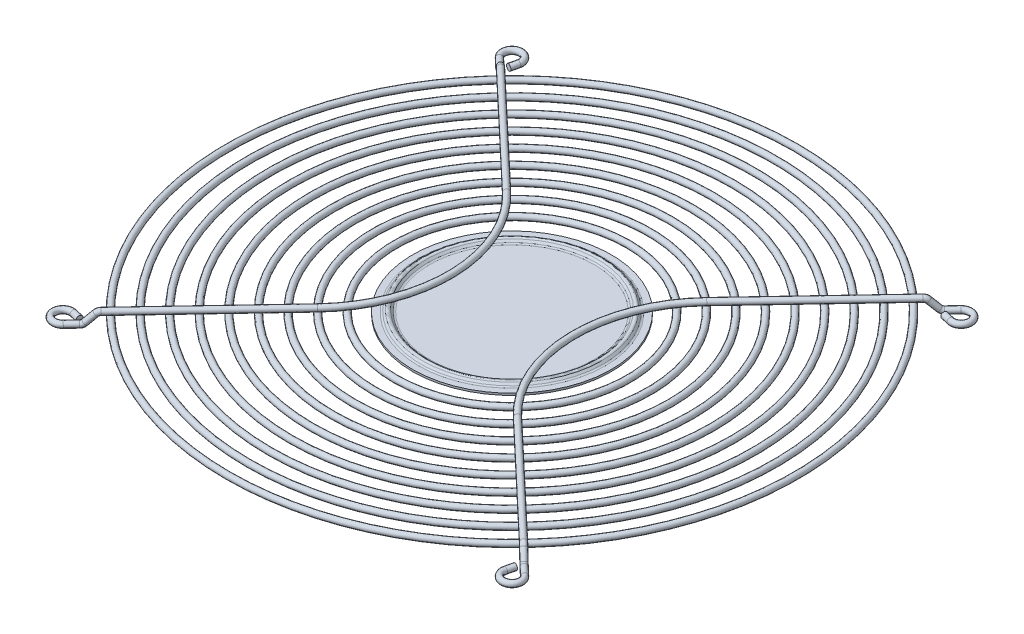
ISO-10303-21;
HEADER;
FILE_DESCRIPTION(('STEP AP214'),'2;1');
FILE_NAME('part.step','',(''),(''),'','','');
FILE_SCHEMA(('AUTOMOTIVE_DESIGN { 1 0 10303 214 1 1 1 1 }'));
ENDSEC;
DATA;
#1=APPLICATION_CONTEXT('core data for automotive mechanical design processes');
#2=APPLICATION_PROTOCOL_DEFINITION('international standard','automotive_design',2000,#1);
#3=PRODUCT_CONTEXT('',#1,'mechanical');
#4=PRODUCT('Part','Part','',(#3));
#5=PRODUCT_RELATED_PRODUCT_CATEGORY('part','',(#4));
#6=PRODUCT_DEFINITION_FORMATION('','',#4);
#7=PRODUCT_DEFINITION_CONTEXT('part definition',#1,'design');
#8=PRODUCT_DEFINITION('design','',#6,#7);
#9=PRODUCT_DEFINITION_SHAPE('','',#8);
#10=(LENGTH_UNIT() NAMED_UNIT(*) SI_UNIT(.MILLI.,.METRE.));
#11=(NAMED_UNIT(*) PLANE_ANGLE_UNIT() SI_UNIT($,.RADIAN.));
#12=(NAMED_UNIT(*) SI_UNIT($,.STERADIAN.) SOLID_ANGLE_UNIT());
#13=UNCERTAINTY_MEASURE_WITH_UNIT(LENGTH_MEASURE(1.E-05),#10,'distance_accuracy_value','');
#14=(GEOMETRIC_REPRESENTATION_CONTEXT(3) GLOBAL_UNCERTAINTY_ASSIGNED_CONTEXT((#13)) GLOBAL_UNIT_ASSIGNED_CONTEXT((#10,
#11,#12)) REPRESENTATION_CONTEXT('',''));
#15=CARTESIAN_POINT('',(0.,0.,0.));
#16=DIRECTION('',(0.,0.,1.));
#17=DIRECTION('',(1.,0.,0.));
#18=AXIS2_PLACEMENT_3D('',#15,#16,#17);
#19=CARTESIAN_POINT('',(32.2857864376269,2.04999999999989,-2.25450441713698E-13));
#20=DIRECTION('',(0.,-1.,0.));
#21=DIRECTION('',(0.,0.,-1.));
#22=AXIS2_PLACEMENT_3D('',#19,#20,#21);
#23=PLANE('',#22);
#24=CARTESIAN_POINT('',(0.,2.04999999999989,0.));
#25=DIRECTION('',(0.,-1.,0.));
#26=DIRECTION('',(0.,0.,-1.));
#27=AXIS2_PLACEMENT_3D('',#24,#25,#26);
#28=CIRCLE('',#27,32.1822330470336);
#29=CARTESIAN_POINT('',(0.,2.04999999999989,-32.1822330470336));
#30=VERTEX_POINT('',#29);
#31=EDGE_CURVE('E50',#30,#30,#28,.T.);
#32=ORIENTED_EDGE('',*,*,#31,.T.);
#33=EDGE_LOOP('',(#32));
#34=FACE_BOUND('',#33,.T.);
#35=ADVANCED_FACE('F39',(#34),#23,.T.);
#36=CARTESIAN_POINT('',(0.,3.27677669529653,0.));
#37=DIRECTION('',(0.,1.,0.));
#38=DIRECTION('',(0.,0.,1.));
#39=AXIS2_PLACEMENT_3D('',#36,#37,#38);
#40=CONICAL_SURFACE('',#39,33.8232233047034,0.78539816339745);
#41=CARTESIAN_POINT('',(0.,2.34289321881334,0.));
#42=DIRECTION('',(0.,-1.,0.));
#43=DIRECTION('',(0.,0.,-1.));
#44=AXIS2_PLACEMENT_3D('',#41,#42,#43);
#45=CIRCLE('',#44,32.8893398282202);
#46=CARTESIAN_POINT('',(0.,2.34289321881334,-32.8893398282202));
#47=VERTEX_POINT('',#46);
#48=EDGE_CURVE('E54',#47,#47,#45,.F.);
#49=ORIENTED_EDGE('',*,*,#48,.T.);
#50=EDGE_LOOP('',(#49));
#51=FACE_BOUND('',#50,.T.);
#52=CARTESIAN_POINT('',(0.,3.27677669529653,0.));
#53=DIRECTION('',(0.,1.,0.));
#54=DIRECTION('',(0.,0.,1.));
#55=AXIS2_PLACEMENT_3D('',#52,#53,#54);
#56=CIRCLE('',#55,33.8232233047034);
#57=CARTESIAN_POINT('',(0.,3.27677669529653,33.8232233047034));
#58=VERTEX_POINT('',#57);
#59=EDGE_CURVE('E71',#58,#58,#56,.T.);
#60=ORIENTED_EDGE('',*,*,#59,.F.);
#61=EDGE_LOOP('',(#60));
#62=FACE_BOUND('',#61,.T.);
#63=ADVANCED_FACE('F110',(#51,#62),#40,.T.);
#64=CARTESIAN_POINT('',(0.,3.09999999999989,0.));
#65=DIRECTION('',(0.,1.,0.));
#66=DIRECTION('',(0.,0.,1.));
#67=AXIS2_PLACEMENT_3D('',#64,#65,#66);
#68=TOROIDAL_SURFACE('',#67,34.,0.250000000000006);
#69=ORIENTED_EDGE('',*,*,#59,.T.);
#70=EDGE_LOOP('',(#69));
#71=FACE_BOUND('',#70,.T.);
#72=CARTESIAN_POINT('',(0.,3.27677669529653,0.));
#73=DIRECTION('',(0.,1.,0.));
#74=DIRECTION('',(0.,0.,1.));
#75=AXIS2_PLACEMENT_3D('',#72,#73,#74);
#76=CIRCLE('',#75,34.1767766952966);
#77=CARTESIAN_POINT('',(0.,3.27677669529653,34.1767766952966));
#78=VERTEX_POINT('',#77);
#79=EDGE_CURVE('E74',#78,#78,#76,.T.);
#80=ORIENTED_EDGE('',*,*,#79,.F.);
#81=EDGE_LOOP('',(#80));
#82=FACE_BOUND('',#81,.T.);
#83=ADVANCED_FACE('F116',(#71,#82),#68,.F.);
#84=CARTESIAN_POINT('',(0.,2.04999999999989,0.));
#85=DIRECTION('',(0.,-1.,0.));
#86=DIRECTION('',(0.,0.,-1.));
#87=AXIS2_PLACEMENT_3D('',#84,#85,#86);
#88=CONICAL_SURFACE('',#87,35.4035533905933,0.785398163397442);
#89=CARTESIAN_POINT('',(0.,2.34289321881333,0.));
#90=DIRECTION('',(0.,1.,0.));
#91=DIRECTION('',(0.,0.,1.));
#92=AXIS2_PLACEMENT_3D('',#89,#90,#91);
#93=CIRCLE('',#92,35.1106601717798);
#94=CARTESIAN_POINT('',(0.,2.34289321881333,35.1106601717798));
#95=VERTEX_POINT('',#94);
#96=EDGE_CURVE('E65',#95,#95,#93,.F.);
#97=ORIENTED_EDGE('',*,*,#96,.T.);
#98=EDGE_LOOP('',(#97));
#99=FACE_BOUND('',#98,.T.);
#100=ORIENTED_EDGE('',*,*,#79,.T.);
#101=EDGE_LOOP('',(#100));
#102=FACE_BOUND('',#101,.T.);
#103=ADVANCED_FACE('F144',(#99,#102),#88,.F.);
#104=CARTESIAN_POINT('',(38.5,2.04999999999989,-2.68844063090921E-13));
#105=DIRECTION('',(0.,-1.,0.));
#106=DIRECTION('',(0.,0.,-1.));
#107=AXIS2_PLACEMENT_3D('',#104,#105,#106);
#108=PLANE('',#107);
#109=CARTESIAN_POINT('',(0.,2.04999999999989,0.));
#110=DIRECTION('',(0.,-1.,0.));
#111=DIRECTION('',(0.,0.,-1.));
#112=AXIS2_PLACEMENT_3D('',#109,#110,#111);
#113=CIRCLE('',#112,35.8177669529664);
#114=CARTESIAN_POINT('',(0.,2.04999999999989,-35.8177669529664));
#115=VERTEX_POINT('',#114);
#116=EDGE_CURVE('E68',#115,#115,#113,.F.);
#117=ORIENTED_EDGE('',*,*,#116,.T.);
#118=EDGE_LOOP('',(#117));
#119=FACE_BOUND('',#118,.T.);
#120=CARTESIAN_POINT('',(0.,2.04999999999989,0.));
#121=DIRECTION('',(0.,1.,0.));
#122=DIRECTION('',(0.,0.,1.));
#123=AXIS2_PLACEMENT_3D('',#120,#121,#122);
#124=CIRCLE('',#123,38.5);
#125=CARTESIAN_POINT('',(0.,2.04999999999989,38.5));
#126=VERTEX_POINT('',#125);
#127=EDGE_CURVE('E77',#126,#126,#124,.T.);
#128=ORIENTED_EDGE('',*,*,#127,.F.);
#129=EDGE_LOOP('',(#128));
#130=FACE_BOUND('',#129,.T.);
#131=ADVANCED_FACE('F148',(#119,#130),#108,.T.);
#132=CARTESIAN_POINT('',(0.,2.95000000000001,0.));
#133=DIRECTION('',(0.,1.,0.));
#134=DIRECTION('',(0.,0.,1.));
#135=AXIS2_PLACEMENT_3D('',#132,#133,#134);
#136=CYLINDRICAL_SURFACE('',#135,38.5);
#137=CARTESIAN_POINT('',(0.,2.79999999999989,0.));
#138=DIRECTION('',(0.,1.,0.));
#139=DIRECTION('',(0.,0.,1.));
#140=AXIS2_PLACEMENT_3D('',#137,#138,#139);
#141=CIRCLE('',#140,38.5);
#142=CARTESIAN_POINT('',(0.,2.79999999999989,38.5));
#143=VERTEX_POINT('',#142);
#144=EDGE_CURVE('E80',#143,#143,#141,.T.);
#145=ORIENTED_EDGE('',*,*,#144,.F.);
#146=EDGE_LOOP('',(#145));
#147=FACE_BOUND('',#146,.T.);
#148=ORIENTED_EDGE('',*,*,#127,.T.);
#149=EDGE_LOOP('',(#148));
#150=FACE_BOUND('',#149,.T.);
#151=ADVANCED_FACE('F106',(#147,#150),#136,.T.);
#152=CARTESIAN_POINT('',(38.5,2.79999999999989,-2.68844063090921E-13));
#153=DIRECTION('',(0.,-1.,0.));
#154=DIRECTION('',(0.,0.,-1.));
#155=AXIS2_PLACEMENT_3D('',#152,#153,#154);
#156=PLANE('',#155);
#157=CARTESIAN_POINT('',(0.,2.79999999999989,0.));
#158=DIRECTION('',(0.,-1.,0.));
#159=DIRECTION('',(0.,0.,-1.));
#160=AXIS2_PLACEMENT_3D('',#157,#158,#159);
#161=CIRCLE('',#160,36.1284271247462);
#162=CARTESIAN_POINT('',(0.,2.79999999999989,-36.1284271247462));
#163=VERTEX_POINT('',#162);
#164=EDGE_CURVE('E59',#163,#163,#161,.T.);
#165=ORIENTED_EDGE('',*,*,#164,.T.);
#166=EDGE_LOOP('',(#165));
#167=FACE_BOUND('',#166,.T.);
#168=ORIENTED_EDGE('',*,*,#144,.T.);
#169=EDGE_LOOP('',(#168));
#170=FACE_BOUND('',#169,.T.);
#171=ADVANCED_FACE('F100',(#167,#170),#156,.F.);
#172=CARTESIAN_POINT('',(0.,2.79999999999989,0.));
#173=DIRECTION('',(0.,-1.,0.));
#174=DIRECTION('',(0.,0.,-1.));
#175=AXIS2_PLACEMENT_3D('',#172,#173,#174);
#176=CONICAL_SURFACE('',#175,35.7142135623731,0.785398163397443);
#177=CARTESIAN_POINT('',(0.,3.09289321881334,0.));
#178=DIRECTION('',(0.,-1.,0.));
#179=DIRECTION('',(0.,0.,-1.));
#180=AXIS2_PLACEMENT_3D('',#177,#178,#179);
#181=CIRCLE('',#180,35.4213203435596);
#182=CARTESIAN_POINT('',(0.,3.09289321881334,-35.4213203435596));
#183=VERTEX_POINT('',#182);
#184=EDGE_CURVE('E62',#183,#183,#181,.F.);
#185=ORIENTED_EDGE('',*,*,#184,.T.);
#186=EDGE_LOOP('',(#185));
#187=FACE_BOUND('',#186,.T.);
#188=CARTESIAN_POINT('',(0.,3.80710678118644,0.));
#189=DIRECTION('',(0.,1.,0.));
#190=DIRECTION('',(0.,0.,1.));
#191=AXIS2_PLACEMENT_3D('',#188,#189,#190);
#192=CIRCLE('',#191,34.7071067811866);
#193=CARTESIAN_POINT('',(0.,3.80710678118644,34.7071067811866));
#194=VERTEX_POINT('',#193);
#195=EDGE_CURVE('E83',#194,#194,#192,.T.);
#196=ORIENTED_EDGE('',*,*,#195,.F.);
#197=EDGE_LOOP('',(#196));
#198=FACE_BOUND('',#197,.T.);
#199=ADVANCED_FACE('F95',(#187,#198),#176,.T.);
#200=CARTESIAN_POINT('',(0.,3.09999999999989,0.));
#201=DIRECTION('',(0.,1.,0.));
#202=DIRECTION('',(0.,0.,1.));
#203=AXIS2_PLACEMENT_3D('',#200,#201,#202);
#204=TOROIDAL_SURFACE('',#203,34.,1.00000000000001);
#205=CARTESIAN_POINT('',(0.,3.80710678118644,0.));
#206=DIRECTION('',(0.,1.,0.));
#207=DIRECTION('',(0.,0.,1.));
#208=AXIS2_PLACEMENT_3D('',#205,#206,#207);
#209=CIRCLE('',#208,33.2928932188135);
#210=CARTESIAN_POINT('',(0.,3.80710678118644,33.2928932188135));
#211=VERTEX_POINT('',#210);
#212=EDGE_CURVE('E86',#211,#211,#209,.T.);
#213=ORIENTED_EDGE('',*,*,#212,.F.);
#214=EDGE_LOOP('',(#213));
#215=FACE_BOUND('',#214,.T.);
#216=ORIENTED_EDGE('',*,*,#195,.T.);
#217=EDGE_LOOP('',(#216));
#218=FACE_BOUND('',#217,.T.);
#219=ADVANCED_FACE('F92',(#215,#218),#204,.T.);
#220=CARTESIAN_POINT('',(0.,3.80710678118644,0.));
#221=DIRECTION('',(0.,1.,0.));
#222=DIRECTION('',(0.,0.,1.));
#223=AXIS2_PLACEMENT_3D('',#220,#221,#222);
#224=CONICAL_SURFACE('',#223,33.2928932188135,0.785398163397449);
#225=CARTESIAN_POINT('',(0.,3.09289321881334,0.));
#226=DIRECTION('',(0.,1.,0.));
#227=DIRECTION('',(0.,0.,1.));
#228=AXIS2_PLACEMENT_3D('',#225,#226,#227);
#229=CIRCLE('',#228,32.5786796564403);
#230=CARTESIAN_POINT('',(0.,3.09289321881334,32.5786796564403));
#231=VERTEX_POINT('',#230);
#232=EDGE_CURVE('E11',#231,#231,#229,.F.);
#233=ORIENTED_EDGE('',*,*,#232,.T.);
#234=EDGE_LOOP('',(#233));
#235=FACE_BOUND('',#234,.T.);
#236=ORIENTED_EDGE('',*,*,#212,.T.);
#237=EDGE_LOOP('',(#236));
#238=FACE_BOUND('',#237,.T.);
#239=ADVANCED_FACE('F90',(#235,#238),#224,.F.);
#240=CARTESIAN_POINT('',(32.2857864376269,2.79999999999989,-2.25450441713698E-13));
#241=DIRECTION('',(0.,-1.,0.));
#242=DIRECTION('',(0.,0.,-1.));
#243=AXIS2_PLACEMENT_3D('',#240,#241,#242);
#244=PLANE('',#243);
#245=CARTESIAN_POINT('',(0.,2.79999999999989,0.));
#246=DIRECTION('',(0.,-1.,0.));
#247=DIRECTION('',(0.,0.,-1.));
#248=AXIS2_PLACEMENT_3D('',#245,#246,#247);
#249=CIRCLE('',#248,31.8715728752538);
#250=CARTESIAN_POINT('',(0.,2.79999999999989,-31.8715728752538));
#251=VERTEX_POINT('',#250);
#252=EDGE_CURVE('E46',#251,#251,#249,.F.);
#253=ORIENTED_EDGE('',*,*,#252,.T.);
#254=EDGE_LOOP('',(#253));
#255=FACE_BOUND('',#254,.T.);
#256=ADVANCED_FACE('F125',(#255),#244,.F.);
#257=CARTESIAN_POINT('',(0.,3.04999999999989,0.));
#258=DIRECTION('',(0.,-1.,0.));
#259=DIRECTION('',(0.,0.,-1.));
#260=AXIS2_PLACEMENT_3D('',#257,#258,#259);
#261=TOROIDAL_SURFACE('',#260,35.8177669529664,1.);
#262=ORIENTED_EDGE('',*,*,#96,.F.);
#263=EDGE_LOOP('',(#262));
#264=FACE_BOUND('',#263,.T.);
#265=ORIENTED_EDGE('',*,*,#116,.F.);
#266=EDGE_LOOP('',(#265));
#267=FACE_BOUND('',#266,.T.);
#268=ADVANCED_FACE('F121',(#264,#267),#261,.T.);
#269=CARTESIAN_POINT('',(0.,3.79999999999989,0.));
#270=DIRECTION('',(0.,-1.,0.));
#271=DIRECTION('',(0.,0.,-1.));
#272=AXIS2_PLACEMENT_3D('',#269,#270,#271);
#273=TOROIDAL_SURFACE('',#272,36.1284271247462,1.);
#274=ORIENTED_EDGE('',*,*,#164,.F.);
#275=EDGE_LOOP('',(#274));
#276=FACE_BOUND('',#275,.T.);
#277=ORIENTED_EDGE('',*,*,#184,.F.);
#278=EDGE_LOOP('',(#277));
#279=FACE_BOUND('',#278,.T.);
#280=ADVANCED_FACE('F124',(#276,#279),#273,.F.);
#281=CARTESIAN_POINT('',(0.,3.04999999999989,0.));
#282=DIRECTION('',(0.,-1.,0.));
#283=DIRECTION('',(0.,0.,-1.));
#284=AXIS2_PLACEMENT_3D('',#281,#282,#283);
#285=TOROIDAL_SURFACE('',#284,32.1822330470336,1.);
#286=ORIENTED_EDGE('',*,*,#31,.F.);
#287=EDGE_LOOP('',(#286));
#288=FACE_BOUND('',#287,.T.);
#289=ORIENTED_EDGE('',*,*,#48,.F.);
#290=EDGE_LOOP('',(#289));
#291=FACE_BOUND('',#290,.T.);
#292=ADVANCED_FACE('F128',(#288,#291),#285,.T.);
#293=CARTESIAN_POINT('',(0.,3.79999999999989,0.));
#294=DIRECTION('',(0.,-1.,0.));
#295=DIRECTION('',(0.,0.,-1.));
#296=AXIS2_PLACEMENT_3D('',#293,#294,#295);
#297=TOROIDAL_SURFACE('',#296,31.8715728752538,1.);
#298=ORIENTED_EDGE('',*,*,#232,.F.);
#299=EDGE_LOOP('',(#298));
#300=FACE_BOUND('',#299,.T.);
#301=ORIENTED_EDGE('',*,*,#252,.F.);
#302=EDGE_LOOP('',(#301));
#303=FACE_BOUND('',#302,.T.);
#304=ADVANCED_FACE('F41',(#300,#303),#297,.F.);
#305=CLOSED_SHELL('',(#35,#63,#83,#103,#131,#151,#171,#199,#219,#239,#256,#268,#280,#292,#304));
#306=MANIFOLD_SOLID_BREP('B2',#305);
#307=CARTESIAN_POINT('',(38.758851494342,5.25000000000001,36.6436990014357));
#308=DIRECTION('',(0.726656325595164,0.,0.687001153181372));
#309=DIRECTION('',(0.687001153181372,0.,-0.726656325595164));
#310=AXIS2_PLACEMENT_3D('',#307,#308,#309);
#311=CYLINDRICAL_SURFACE('',#310,1.15);
#312=CARTESIAN_POINT('',(38.758851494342,5.25000000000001,36.6436990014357));
#313=DIRECTION('',(-0.726656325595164,0.,-0.687001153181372));
#314=DIRECTION('',(-0.687001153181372,0.,0.726656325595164));
#315=AXIS2_PLACEMENT_3D('',#312,#313,#314);
#316=CIRCLE('',#315,1.15);
#317=CARTESIAN_POINT('',(37.9688001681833,5.25000000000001,37.4793537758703));
#318=VERTEX_POINT('',#317);
#319=EDGE_CURVE('E38',#318,#318,#316,.T.);
#320=ORIENTED_EDGE('',*,*,#319,.F.);
#321=EDGE_LOOP('',(#320));
#322=FACE_BOUND('',#321,.T.);
#323=CARTESIAN_POINT('',(81.8578350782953,5.25000000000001,77.3906799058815));
#324=DIRECTION('',(0.726656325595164,0.,0.687001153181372));
#325=DIRECTION('',(0.687001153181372,0.,-0.726656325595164));
#326=AXIS2_PLACEMENT_3D('',#323,#324,#325);
#327=CIRCLE('',#326,1.15000000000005);
#328=CARTESIAN_POINT('',(81.8578350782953,6.40000000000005,77.3906799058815));
#329=VERTEX_POINT('',#328);
#330=EDGE_CURVE('E287',#329,#329,#327,.T.);
#331=ORIENTED_EDGE('',*,*,#330,.F.);
#332=EDGE_LOOP('',(#331));
#333=FACE_BOUND('',#332,.T.);
#334=ADVANCED_FACE('F267',(#322,#333),#311,.T.);
#335=CARTESIAN_POINT('',(86.1002005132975,1.15000000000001,81.4015304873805));
#336=DIRECTION('',(0.726656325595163,0.,0.687001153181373));
#337=DIRECTION('',(0.687001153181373,0.,-0.726656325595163));
#338=AXIS2_PLACEMENT_3D('',#335,#336,#337);
#339=CYLINDRICAL_SURFACE('',#338,1.15000000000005);
#340=CARTESIAN_POINT('',(86.1002005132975,1.15000000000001,81.4015304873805));
#341=DIRECTION('',(0.726656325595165,0.,0.687001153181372));
#342=DIRECTION('',(0.687001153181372,0.,-0.726656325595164));
#343=AXIS2_PLACEMENT_3D('',#340,#341,#342);
#344=CIRCLE('',#343,1.15000000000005);
#345=CARTESIAN_POINT('',(86.1002005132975,0.,81.4015304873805));
#346=VERTEX_POINT('',#345);
#347=EDGE_CURVE('E277',#346,#346,#344,.T.);
#348=ORIENTED_EDGE('',*,*,#347,.T.);
#349=EDGE_LOOP('',(#348));
#350=FACE_BOUND('',#349,.T.);
#351=CARTESIAN_POINT('',(89.3701539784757,1.15000000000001,84.4930356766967));
#352=DIRECTION('',(0.726656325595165,0.,0.687001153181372));
#353=DIRECTION('',(0.687001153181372,0.,-0.726656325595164));
#354=AXIS2_PLACEMENT_3D('',#351,#352,#353);
#355=CIRCLE('',#354,1.15000000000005);
#356=CARTESIAN_POINT('',(90.1602053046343,1.15000000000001,83.6573809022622));
#357=VERTEX_POINT('',#356);
#358=EDGE_CURVE('E270',#357,#357,#355,.T.);
#359=ORIENTED_EDGE('',*,*,#358,.F.);
#360=EDGE_LOOP('',(#359));
#361=FACE_BOUND('',#360,.T.);
#362=ADVANCED_FACE('F348',(#350,#361),#339,.T.);
#363=CARTESIAN_POINT('',(86.1002005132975,3.15,81.4015304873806));
#364=DIRECTION('',(-0.687001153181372,0.,0.726656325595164));
#365=DIRECTION('',(0.726656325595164,0.,0.687001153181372));
#366=AXIS2_PLACEMENT_3D('',#363,#364,#365);
#367=TOROIDAL_SURFACE('',#366,2.,1.15000000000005);
#368=CARTESIAN_POINT('',(85.0866340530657,1.7166708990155,80.4432764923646));
#369=DIRECTION('',(0.520768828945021,-0.697418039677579,0.492349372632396));
#370=DIRECTION('',(0.687001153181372,0.,-0.726656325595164));
#371=AXIS2_PLACEMENT_3D('',#368,#369,#370);
#372=CIRCLE('',#371,1.15000000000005);
#373=CARTESIAN_POINT('',(84.5038333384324,0.892506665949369,79.8922804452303));
#374=VERTEX_POINT('',#373);
#375=EDGE_CURVE('E281',#374,#374,#372,.T.);
#376=CARTESIAN_POINT('',(86.1002005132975,3.15,81.4015304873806));
#377=DIRECTION('',(-0.687001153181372,0.,0.726656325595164));
#378=DIRECTION('',(0.726656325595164,0.,0.687001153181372));
#379=AXIS2_PLACEMENT_3D('',#376,#377,#378);
#380=CIRCLE('',#379,3.15000000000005);
#381=EDGE_CURVE('',#374,#346,#380,.T.);
#382=ORIENTED_EDGE('',*,*,#375,.T.);
#383=ORIENTED_EDGE('',*,*,#347,.F.);
#384=ORIENTED_EDGE('',*,*,#381,.T.);
#385=ORIENTED_EDGE('',*,*,#381,.F.);
#386=EDGE_LOOP('',(#382,#384,#383,#385));
#387=FACE_BOUND('',#386,.T.);
#388=ADVANCED_FACE('F353',(#387),#367,.T.);
#389=CARTESIAN_POINT('',(82.8714015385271,4.68332910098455,78.3489339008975));
#390=DIRECTION('',(0.52076882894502,-0.697418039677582,0.492349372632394));
#391=DIRECTION('',(-0.801263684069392,-0.598311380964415,0.));
#392=AXIS2_PLACEMENT_3D('',#389,#390,#391);
#393=CYLINDRICAL_SURFACE('',#392,1.15000000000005);
#394=CARTESIAN_POINT('',(82.8714015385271,4.68332910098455,78.3489339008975));
#395=DIRECTION('',(0.520768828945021,-0.697418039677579,0.492349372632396));
#396=DIRECTION('',(0.687001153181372,0.,-0.726656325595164));
#397=AXIS2_PLACEMENT_3D('',#394,#395,#396);
#398=CIRCLE('',#397,1.15000000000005);
#399=CARTESIAN_POINT('',(83.4542022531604,5.50749333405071,78.8999299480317));
#400=VERTEX_POINT('',#399);
#401=EDGE_CURVE('E284',#400,#400,#398,.T.);
#402=ORIENTED_EDGE('',*,*,#401,.T.);
#403=EDGE_LOOP('',(#402));
#404=FACE_BOUND('',#403,.T.);
#405=ORIENTED_EDGE('',*,*,#375,.F.);
#406=EDGE_LOOP('',(#405));
#407=FACE_BOUND('',#406,.T.);
#408=ADVANCED_FACE('F361',(#404,#407),#393,.T.);
#409=CARTESIAN_POINT('',(81.8578350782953,3.25000000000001,77.3906799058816));
#410=DIRECTION('',(-0.687001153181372,0.,0.726656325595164));
#411=DIRECTION('',(0.726656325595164,0.,0.687001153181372));
#412=AXIS2_PLACEMENT_3D('',#409,#410,#411);
#413=TOROIDAL_SURFACE('',#412,1.99999999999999,1.15000000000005);
#414=CARTESIAN_POINT('',(81.8578350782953,3.25000000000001,77.3906799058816));
#415=DIRECTION('',(-0.687001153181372,0.,0.726656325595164));
#416=DIRECTION('',(0.726656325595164,0.,0.687001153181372));
#417=AXIS2_PLACEMENT_3D('',#414,#415,#416);
#418=CIRCLE('',#417,3.15000000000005);
#419=EDGE_CURVE('',#400,#329,#418,.T.);
#420=ORIENTED_EDGE('',*,*,#401,.F.);
#421=ORIENTED_EDGE('',*,*,#330,.T.);
#422=ORIENTED_EDGE('',*,*,#419,.T.);
#423=ORIENTED_EDGE('',*,*,#419,.F.);
#424=EDGE_LOOP('',(#420,#422,#421,#423));
#425=FACE_BOUND('',#424,.T.);
#426=ADVANCED_FACE('F358',(#425),#413,.T.);
#427=CARTESIAN_POINT('',(83.6438282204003,1.15000000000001,86.2008686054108));
#428=DIRECTION('',(0.231632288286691,0.,-0.972803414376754));
#429=DIRECTION('',(-0.972803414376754,0.,-0.231632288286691));
#430=AXIS2_PLACEMENT_3D('',#427,#428,#429);
#431=CYLINDRICAL_SURFACE('',#430,1.15000000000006);
#432=CARTESIAN_POINT('',(83.6438282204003,1.15000000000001,86.2008686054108));
#433=DIRECTION('',(0.231632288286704,0.,-0.972803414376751));
#434=DIRECTION('',(-0.972803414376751,0.,-0.231632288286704));
#435=AXIS2_PLACEMENT_3D('',#432,#433,#434);
#436=CIRCLE('',#435,1.15000000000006);
#437=CARTESIAN_POINT('',(82.5251042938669,1.15000000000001,85.9344914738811));
#438=VERTEX_POINT('',#437);
#439=EDGE_CURVE('E293',#438,#438,#436,.T.);
#440=ORIENTED_EDGE('',*,*,#439,.T.);
#441=EDGE_LOOP('',(#440));
#442=FACE_BOUND('',#441,.T.);
#443=CARTESIAN_POINT('',(84.3811498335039,1.15000000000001,83.1042839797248));
#444=DIRECTION('',(0.231632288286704,0.,-0.972803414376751));
#445=DIRECTION('',(-0.972803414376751,0.,-0.231632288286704));
#446=AXIS2_PLACEMENT_3D('',#443,#444,#445);
#447=CIRCLE('',#446,1.15000000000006);
#448=CARTESIAN_POINT('',(83.2624259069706,1.15000000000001,82.8379068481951));
#449=VERTEX_POINT('',#448);
#450=EDGE_CURVE('E290',#449,#449,#447,.T.);
#451=ORIENTED_EDGE('',*,*,#450,.F.);
#452=EDGE_LOOP('',(#451));
#453=FACE_BOUND('',#452,.T.);
#454=ADVANCED_FACE('F360',(#442,#453),#431,.T.);
#455=CARTESIAN_POINT('',(87.,1.15000000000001,87.));
#456=DIRECTION('',(0.,1.,0.));
#457=DIRECTION('',(0.,0.,-1.));
#458=AXIS2_PLACEMENT_3D('',#455,#456,#457);
#459=TOROIDAL_SURFACE('',#458,3.44999999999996,1.15000000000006);
#460=CARTESIAN_POINT('',(87.,1.15000000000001,87.));
#461=DIRECTION('',(0.,1.,0.));
#462=DIRECTION('',(0.,0.,-1.));
#463=AXIS2_PLACEMENT_3D('',#460,#461,#462);
#464=CIRCLE('',#463,4.60000000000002);
#465=EDGE_CURVE('',#438,#357,#464,.T.);
#466=ORIENTED_EDGE('',*,*,#439,.F.);
#467=ORIENTED_EDGE('',*,*,#358,.T.);
#468=ORIENTED_EDGE('',*,*,#465,.T.);
#469=ORIENTED_EDGE('',*,*,#465,.F.);
#470=EDGE_LOOP('',(#466,#468,#467,#469));
#471=FACE_BOUND('',#470,.T.);
#472=ADVANCED_FACE('F368',(#471),#459,.T.);
#473=CARTESIAN_POINT('',(84.3811498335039,1.15000000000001,83.1042839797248));
#474=DIRECTION('',(0.231632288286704,0.,-0.972803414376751));
#475=DIRECTION('',(-0.972803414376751,0.,-0.231632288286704));
#476=AXIS2_PLACEMENT_3D('',#473,#474,#475);
#477=PLANE('',#476);
#478=ORIENTED_EDGE('',*,*,#450,.T.);
#479=EDGE_LOOP('',(#478));
#480=FACE_BOUND('',#479,.T.);
#481=ADVANCED_FACE('F371',(#480),#477,.T.);
#482=CARTESIAN_POINT('',(75.4025504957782,5.25000000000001,-2.11515249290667));
#483=DIRECTION('',(0.,-1.,0.));
#484=DIRECTION('',(0.,0.,-1.));
#485=AXIS2_PLACEMENT_3D('',#482,#483,#484);
#486=TOROIDAL_SURFACE('',#485,53.3386280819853,1.15000000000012);
#487=CARTESIAN_POINT('',(36.6436990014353,5.25000000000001,-38.7588514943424));
#488=DIRECTION('',(-0.687001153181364,0.,0.726656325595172));
#489=DIRECTION('',(0.726656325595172,0.,0.687001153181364));
#490=AXIS2_PLACEMENT_3D('',#487,#488,#489);
#491=CIRCLE('',#490,1.15);
#492=CARTESIAN_POINT('',(35.8080442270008,5.25000000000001,-39.5489028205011));
#493=VERTEX_POINT('',#492);
#494=EDGE_CURVE('E296',#493,#493,#491,.T.);
#495=CARTESIAN_POINT('',(75.4025504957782,5.25000000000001,-2.11515249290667));
#496=DIRECTION('',(0.,-1.,0.));
#497=DIRECTION('',(0.,0.,-1.));
#498=AXIS2_PLACEMENT_3D('',#495,#496,#497);
#499=CIRCLE('',#498,54.4886280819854);
#500=EDGE_CURVE('',#318,#493,#499,.T.);
#501=ORIENTED_EDGE('',*,*,#319,.T.);
#502=ORIENTED_EDGE('',*,*,#494,.T.);
#503=ORIENTED_EDGE('',*,*,#500,.T.);
#504=ORIENTED_EDGE('',*,*,#500,.F.);
#505=EDGE_LOOP('',(#501,#503,#502,#504));
#506=FACE_BOUND('',#505,.T.);
#507=ADVANCED_FACE('F344',(#506),#486,.T.);
#508=CARTESIAN_POINT('',(36.6436990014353,5.25000000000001,-38.7588514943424));
#509=DIRECTION('',(0.687001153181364,0.,-0.726656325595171));
#510=DIRECTION('',(-0.726656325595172,0.,-0.687001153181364));
#511=AXIS2_PLACEMENT_3D('',#508,#509,#510);
#512=CYLINDRICAL_SURFACE('',#511,1.15);
#513=ORIENTED_EDGE('',*,*,#494,.F.);
#514=EDGE_LOOP('',(#513));
#515=FACE_BOUND('',#514,.T.);
#516=CARTESIAN_POINT('',(77.3906799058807,5.25000000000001,-81.8578350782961));
#517=DIRECTION('',(0.687001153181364,0.,-0.726656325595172));
#518=DIRECTION('',(-0.726656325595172,0.,-0.687001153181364));
#519=AXIS2_PLACEMENT_3D('',#516,#517,#518);
#520=CIRCLE('',#519,1.15000000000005);
#521=CARTESIAN_POINT('',(77.3906799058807,6.40000000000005,-81.8578350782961));
#522=VERTEX_POINT('',#521);
#523=EDGE_CURVE('E311',#522,#522,#520,.T.);
#524=ORIENTED_EDGE('',*,*,#523,.F.);
#525=EDGE_LOOP('',(#524));
#526=FACE_BOUND('',#525,.T.);
#527=ADVANCED_FACE('F334',(#515,#526),#512,.T.);
#528=CARTESIAN_POINT('',(81.4015304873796,1.15000000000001,-86.1002005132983));
#529=DIRECTION('',(0.687001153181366,0.,-0.72665632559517));
#530=DIRECTION('',(-0.72665632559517,0.,-0.687001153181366));
#531=AXIS2_PLACEMENT_3D('',#528,#529,#530);
#532=CYLINDRICAL_SURFACE('',#531,1.15000000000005);
#533=CARTESIAN_POINT('',(81.4015304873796,1.15000000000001,-86.1002005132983));
#534=DIRECTION('',(0.687001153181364,0.,-0.726656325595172));
#535=DIRECTION('',(-0.726656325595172,0.,-0.687001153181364));
#536=AXIS2_PLACEMENT_3D('',#533,#534,#535);
#537=CIRCLE('',#536,1.15000000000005);
#538=CARTESIAN_POINT('',(81.4015304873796,0.,-86.1002005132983));
#539=VERTEX_POINT('',#538);
#540=EDGE_CURVE('E300',#539,#539,#537,.T.);
#541=ORIENTED_EDGE('',*,*,#540,.T.);
#542=EDGE_LOOP('',(#541));
#543=FACE_BOUND('',#542,.T.);
#544=CARTESIAN_POINT('',(84.4930356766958,1.15000000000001,-89.3701539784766));
#545=DIRECTION('',(0.687001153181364,0.,-0.726656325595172));
#546=DIRECTION('',(-0.726656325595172,0.,-0.687001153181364));
#547=AXIS2_PLACEMENT_3D('',#544,#545,#546);
#548=CIRCLE('',#547,1.15000000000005);
#549=CARTESIAN_POINT('',(83.6573809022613,1.15000000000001,-90.1602053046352));
#550=VERTEX_POINT('',#549);
#551=EDGE_CURVE('E297',#550,#550,#548,.T.);
#552=ORIENTED_EDGE('',*,*,#551,.F.);
#553=EDGE_LOOP('',(#552));
#554=FACE_BOUND('',#553,.T.);
#555=ADVANCED_FACE('F331',(#543,#554),#532,.T.);
#556=CARTESIAN_POINT('',(81.4015304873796,3.15,-86.1002005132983));
#557=DIRECTION('',(0.726656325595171,0.,0.687001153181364));
#558=DIRECTION('',(0.687001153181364,0.,-0.726656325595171));
#559=AXIS2_PLACEMENT_3D('',#556,#557,#558);
#560=TOROIDAL_SURFACE('',#559,2.,1.15000000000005);
#561=CARTESIAN_POINT('',(80.4432764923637,1.7166708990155,-85.0866340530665));
#562=DIRECTION('',(0.492349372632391,-0.697418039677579,-0.520768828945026));
#563=DIRECTION('',(-0.726656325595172,0.,-0.687001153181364));
#564=AXIS2_PLACEMENT_3D('',#561,#562,#563);
#565=CIRCLE('',#564,1.15000000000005);
#566=CARTESIAN_POINT('',(79.8922804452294,0.892506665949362,-84.5038333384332));
#567=VERTEX_POINT('',#566);
#568=EDGE_CURVE('E305',#567,#567,#565,.T.);
#569=CARTESIAN_POINT('',(81.4015304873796,3.15,-86.1002005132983));
#570=DIRECTION('',(0.726656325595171,0.,0.687001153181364));
#571=DIRECTION('',(0.687001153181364,0.,-0.726656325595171));
#572=AXIS2_PLACEMENT_3D('',#569,#570,#571);
#573=CIRCLE('',#572,3.15000000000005);
#574=EDGE_CURVE('',#567,#539,#573,.T.);
#575=ORIENTED_EDGE('',*,*,#568,.T.);
#576=ORIENTED_EDGE('',*,*,#540,.F.);
#577=ORIENTED_EDGE('',*,*,#574,.T.);
#578=ORIENTED_EDGE('',*,*,#574,.F.);
#579=EDGE_LOOP('',(#575,#577,#576,#578));
#580=FACE_BOUND('',#579,.T.);
#581=ADVANCED_FACE('F333',(#580),#560,.T.);
#582=CARTESIAN_POINT('',(78.3489339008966,4.68332910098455,-82.8714015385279));
#583=DIRECTION('',(0.492349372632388,-0.697418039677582,-0.520768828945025));
#584=DIRECTION('',(0.,-0.598311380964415,0.801263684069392));
#585=AXIS2_PLACEMENT_3D('',#582,#583,#584);
#586=CYLINDRICAL_SURFACE('',#585,1.15000000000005);
#587=CARTESIAN_POINT('',(78.3489339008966,4.68332910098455,-82.8714015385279));
#588=DIRECTION('',(0.492349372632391,-0.697418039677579,-0.520768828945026));
#589=DIRECTION('',(-0.726656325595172,0.,-0.687001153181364));
#590=AXIS2_PLACEMENT_3D('',#587,#588,#589);
#591=CIRCLE('',#590,1.15000000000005);
#592=CARTESIAN_POINT('',(78.8999299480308,5.50749333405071,-83.4542022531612));
#593=VERTEX_POINT('',#592);
#594=EDGE_CURVE('E308',#593,#593,#591,.T.);
#595=ORIENTED_EDGE('',*,*,#594,.T.);
#596=EDGE_LOOP('',(#595));
#597=FACE_BOUND('',#596,.T.);
#598=ORIENTED_EDGE('',*,*,#568,.F.);
#599=EDGE_LOOP('',(#598));
#600=FACE_BOUND('',#599,.T.);
#601=ADVANCED_FACE('F341',(#597,#600),#586,.T.);
#602=CARTESIAN_POINT('',(77.3906799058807,3.25000000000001,-81.8578350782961));
#603=DIRECTION('',(0.726656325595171,0.,0.687001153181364));
#604=DIRECTION('',(0.687001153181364,0.,-0.726656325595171));
#605=AXIS2_PLACEMENT_3D('',#602,#603,#604);
#606=TOROIDAL_SURFACE('',#605,1.99999999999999,1.15000000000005);
#607=CARTESIAN_POINT('',(77.3906799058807,3.25000000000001,-81.8578350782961));
#608=DIRECTION('',(0.726656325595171,0.,0.687001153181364));
#609=DIRECTION('',(0.687001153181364,0.,-0.726656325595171));
#610=AXIS2_PLACEMENT_3D('',#607,#608,#609);
#611=CIRCLE('',#610,3.15000000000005);
#612=EDGE_CURVE('',#593,#522,#611,.T.);
#613=ORIENTED_EDGE('',*,*,#594,.F.);
#614=ORIENTED_EDGE('',*,*,#523,.T.);
#615=ORIENTED_EDGE('',*,*,#612,.T.);
#616=ORIENTED_EDGE('',*,*,#612,.F.);
#617=EDGE_LOOP('',(#613,#615,#614,#616));
#618=FACE_BOUND('',#617,.T.);
#619=ADVANCED_FACE('F404',(#618),#606,.T.);
#620=CARTESIAN_POINT('',(86.20086860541,1.15000000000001,-83.6438282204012));
#621=DIRECTION('',(-0.972803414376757,0.,-0.231632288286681));
#622=DIRECTION('',(-0.231632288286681,0.,0.972803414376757));
#623=AXIS2_PLACEMENT_3D('',#620,#621,#622);
#624=CYLINDRICAL_SURFACE('',#623,1.15000000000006);
#625=CARTESIAN_POINT('',(86.20086860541,1.15000000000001,-83.6438282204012));
#626=DIRECTION('',(-0.972803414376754,0.,-0.231632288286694));
#627=DIRECTION('',(-0.231632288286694,0.,0.972803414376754));
#628=AXIS2_PLACEMENT_3D('',#625,#626,#627);
#629=CIRCLE('',#628,1.15000000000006);
#630=CARTESIAN_POINT('',(85.9344914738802,1.15000000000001,-82.5251042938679));
#631=VERTEX_POINT('',#630);
#632=EDGE_CURVE('E317',#631,#631,#629,.T.);
#633=ORIENTED_EDGE('',*,*,#632,.T.);
#634=EDGE_LOOP('',(#633));
#635=FACE_BOUND('',#634,.T.);
#636=CARTESIAN_POINT('',(83.1042839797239,1.15000000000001,-84.3811498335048));
#637=DIRECTION('',(-0.972803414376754,0.,-0.231632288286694));
#638=DIRECTION('',(-0.231632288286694,0.,0.972803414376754));
#639=AXIS2_PLACEMENT_3D('',#636,#637,#638);
#640=CIRCLE('',#639,1.15000000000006);
#641=CARTESIAN_POINT('',(82.8379068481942,1.15000000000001,-83.2624259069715));
#642=VERTEX_POINT('',#641);
#643=EDGE_CURVE('E314',#642,#642,#640,.T.);
#644=ORIENTED_EDGE('',*,*,#643,.F.);
#645=EDGE_LOOP('',(#644));
#646=FACE_BOUND('',#645,.T.);
#647=ADVANCED_FACE('F321',(#635,#646),#624,.T.);
#648=CARTESIAN_POINT('',(86.9999999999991,1.15000000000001,-87.0000000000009));
#649=DIRECTION('',(0.,1.,0.));
#650=DIRECTION('',(-1.,0.,0.));
#651=AXIS2_PLACEMENT_3D('',#648,#649,#650);
#652=TOROIDAL_SURFACE('',#651,3.44999999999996,1.15000000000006);
#653=CARTESIAN_POINT('',(86.9999999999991,1.15000000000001,-87.0000000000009));
#654=DIRECTION('',(0.,1.,0.));
#655=DIRECTION('',(-1.,0.,0.));
#656=AXIS2_PLACEMENT_3D('',#653,#654,#655);
#657=CIRCLE('',#656,4.60000000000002);
#658=EDGE_CURVE('',#631,#550,#657,.T.);
#659=ORIENTED_EDGE('',*,*,#632,.F.);
#660=ORIENTED_EDGE('',*,*,#551,.T.);
#661=ORIENTED_EDGE('',*,*,#658,.T.);
#662=ORIENTED_EDGE('',*,*,#658,.F.);
#663=EDGE_LOOP('',(#659,#661,#660,#662));
#664=FACE_BOUND('',#663,.T.);
#665=ADVANCED_FACE('F324',(#664),#652,.T.);
#666=CARTESIAN_POINT('',(83.1042839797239,1.15000000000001,-84.3811498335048));
#667=DIRECTION('',(-0.972803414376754,0.,-0.231632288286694));
#668=DIRECTION('',(-0.231632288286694,0.,0.972803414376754));
#669=AXIS2_PLACEMENT_3D('',#666,#667,#668);
#670=PLANE('',#669);
#671=ORIENTED_EDGE('',*,*,#643,.T.);
#672=EDGE_LOOP('',(#671));
#673=FACE_BOUND('',#672,.T.);
#674=ADVANCED_FACE('F327',(#673),#670,.T.);
#675=CLOSED_SHELL('',(#334,#362,#388,#408,#426,#454,#472,#481,#507,#527,#555,#581,#601,#619,
#647,#665,#674));
#676=MANIFOLD_SOLID_BREP('B6',#675);
#677=CARTESIAN_POINT('',(-36.6436990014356,5.25000000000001,38.7588514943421));
#678=DIRECTION('',(-0.687001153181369,0.,0.726656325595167));
#679=DIRECTION('',(0.726656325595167,0.,0.687001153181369));
#680=AXIS2_PLACEMENT_3D('',#677,#678,#679);
#681=CYLINDRICAL_SURFACE('',#680,1.15);
#682=CARTESIAN_POINT('',(-36.6436990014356,5.25000000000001,38.7588514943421));
#683=DIRECTION('',(0.687001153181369,0.,-0.726656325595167));
#684=DIRECTION('',(-0.726656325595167,0.,-0.687001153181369));
#685=AXIS2_PLACEMENT_3D('',#682,#683,#684);
#686=CIRCLE('',#685,1.15);
#687=CARTESIAN_POINT('',(-35.8080442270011,5.25000000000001,39.5489028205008));
#688=VERTEX_POINT('',#687);
#689=EDGE_CURVE('E266',#688,#688,#686,.T.);
#690=ORIENTED_EDGE('',*,*,#689,.F.);
#691=EDGE_LOOP('',(#690));
#692=FACE_BOUND('',#691,.T.);
#693=CARTESIAN_POINT('',(-77.3906799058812,5.25000000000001,81.8578350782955));
#694=DIRECTION('',(-0.687001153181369,0.,0.726656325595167));
#695=DIRECTION('',(0.726656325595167,0.,0.687001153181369));
#696=AXIS2_PLACEMENT_3D('',#693,#694,#695);
#697=CIRCLE('',#696,1.15000000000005);
#698=CARTESIAN_POINT('',(-77.3906799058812,6.40000000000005,81.8578350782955));
#699=VERTEX_POINT('',#698);
#700=EDGE_CURVE('E543',#699,#699,#697,.T.);
#701=ORIENTED_EDGE('',*,*,#700,.F.);
#702=EDGE_LOOP('',(#701));
#703=FACE_BOUND('',#702,.T.);
#704=ADVANCED_FACE('F523',(#692,#703),#681,.T.);
#705=CARTESIAN_POINT('',(-81.4015304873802,1.15000000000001,86.1002005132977));
#706=DIRECTION('',(-0.687001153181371,0.,0.726656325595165));
#707=DIRECTION('',(0.726656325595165,0.,0.687001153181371));
#708=AXIS2_PLACEMENT_3D('',#705,#706,#707);
#709=CYLINDRICAL_SURFACE('',#708,1.15000000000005);
#710=CARTESIAN_POINT('',(-81.4015304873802,1.15000000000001,86.1002005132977));
#711=DIRECTION('',(-0.687001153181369,0.,0.726656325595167));
#712=DIRECTION('',(0.726656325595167,0.,0.687001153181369));
#713=AXIS2_PLACEMENT_3D('',#710,#711,#712);
#714=CIRCLE('',#713,1.15000000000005);
#715=CARTESIAN_POINT('',(-81.4015304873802,0.,86.1002005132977));
#716=VERTEX_POINT('',#715);
#717=EDGE_CURVE('E533',#716,#716,#714,.T.);
#718=ORIENTED_EDGE('',*,*,#717,.T.);
#719=EDGE_LOOP('',(#718));
#720=FACE_BOUND('',#719,.T.);
#721=CARTESIAN_POINT('',(-84.4930356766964,1.15000000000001,89.370153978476));
#722=DIRECTION('',(-0.687001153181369,0.,0.726656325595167));
#723=DIRECTION('',(0.726656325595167,0.,0.687001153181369));
#724=AXIS2_PLACEMENT_3D('',#721,#722,#723);
#725=CIRCLE('',#724,1.15000000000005);
#726=CARTESIAN_POINT('',(-83.6573809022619,1.15000000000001,90.1602053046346));
#727=VERTEX_POINT('',#726);
#728=EDGE_CURVE('E526',#727,#727,#725,.T.);
#729=ORIENTED_EDGE('',*,*,#728,.F.);
#730=EDGE_LOOP('',(#729));
#731=FACE_BOUND('',#730,.T.);
#732=ADVANCED_FACE('F604',(#720,#731),#709,.T.);
#733=CARTESIAN_POINT('',(-81.4015304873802,3.15,86.1002005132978));
#734=DIRECTION('',(-0.726656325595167,0.,-0.687001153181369));
#735=DIRECTION('',(-0.687001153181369,0.,0.726656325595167));
#736=AXIS2_PLACEMENT_3D('',#733,#734,#735);
#737=TOROIDAL_SURFACE('',#736,2.,1.15000000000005);
#738=CARTESIAN_POINT('',(-80.4432764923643,1.7166708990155,85.086634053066));
#739=DIRECTION('',(-0.492349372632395,-0.697418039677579,0.520768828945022));
#740=DIRECTION('',(0.726656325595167,0.,0.687001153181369));
#741=AXIS2_PLACEMENT_3D('',#738,#739,#740);
#742=CIRCLE('',#741,1.15000000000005);
#743=CARTESIAN_POINT('',(-79.89228044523,0.892506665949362,84.5038333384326));
#744=VERTEX_POINT('',#743);
#745=EDGE_CURVE('E537',#744,#744,#742,.T.);
#746=CARTESIAN_POINT('',(-81.4015304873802,3.15,86.1002005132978));
#747=DIRECTION('',(-0.726656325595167,0.,-0.687001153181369));
#748=DIRECTION('',(-0.687001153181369,0.,0.726656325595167));
#749=AXIS2_PLACEMENT_3D('',#746,#747,#748);
#750=CIRCLE('',#749,3.15000000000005);
#751=EDGE_CURVE('',#744,#716,#750,.T.);
#752=ORIENTED_EDGE('',*,*,#745,.T.);
#753=ORIENTED_EDGE('',*,*,#717,.F.);
#754=ORIENTED_EDGE('',*,*,#751,.T.);
#755=ORIENTED_EDGE('',*,*,#751,.F.);
#756=EDGE_LOOP('',(#752,#754,#753,#755));
#757=FACE_BOUND('',#756,.T.);
#758=ADVANCED_FACE('F609',(#757),#737,.T.);
#759=CARTESIAN_POINT('',(-78.3489339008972,4.68332910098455,82.8714015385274));
#760=DIRECTION('',(-0.492349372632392,-0.697418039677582,0.520768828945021));
#761=DIRECTION('',(0.,-0.598311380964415,-0.801263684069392));
#762=AXIS2_PLACEMENT_3D('',#759,#760,#761);
#763=CYLINDRICAL_SURFACE('',#762,1.15000000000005);
#764=CARTESIAN_POINT('',(-78.3489339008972,4.68332910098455,82.8714015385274));
#765=DIRECTION('',(-0.492349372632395,-0.697418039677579,0.520768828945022));
#766=DIRECTION('',(0.726656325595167,0.,0.687001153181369));
#767=AXIS2_PLACEMENT_3D('',#764,#765,#766);
#768=CIRCLE('',#767,1.15000000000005);
#769=CARTESIAN_POINT('',(-78.8999299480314,5.5074933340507,83.4542022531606));
#770=VERTEX_POINT('',#769);
#771=EDGE_CURVE('E540',#770,#770,#768,.T.);
#772=ORIENTED_EDGE('',*,*,#771,.T.);
#773=EDGE_LOOP('',(#772));
#774=FACE_BOUND('',#773,.T.);
#775=ORIENTED_EDGE('',*,*,#745,.F.);
#776=EDGE_LOOP('',(#775));
#777=FACE_BOUND('',#776,.T.);
#778=ADVANCED_FACE('F617',(#774,#777),#763,.T.);
#779=CARTESIAN_POINT('',(-77.3906799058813,3.25000000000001,81.8578350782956));
#780=DIRECTION('',(-0.726656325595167,0.,-0.687001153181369));
#781=DIRECTION('',(-0.687001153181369,0.,0.726656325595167));
#782=AXIS2_PLACEMENT_3D('',#779,#780,#781);
#783=TOROIDAL_SURFACE('',#782,1.99999999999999,1.15000000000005);
#784=CARTESIAN_POINT('',(-77.3906799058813,3.25000000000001,81.8578350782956));
#785=DIRECTION('',(-0.726656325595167,0.,-0.687001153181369));
#786=DIRECTION('',(-0.687001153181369,0.,0.726656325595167));
#787=AXIS2_PLACEMENT_3D('',#784,#785,#786);
#788=CIRCLE('',#787,3.15000000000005);
#789=EDGE_CURVE('',#770,#699,#788,.T.);
#790=ORIENTED_EDGE('',*,*,#771,.F.);
#791=ORIENTED_EDGE('',*,*,#700,.T.);
#792=ORIENTED_EDGE('',*,*,#789,.T.);
#793=ORIENTED_EDGE('',*,*,#789,.F.);
#794=EDGE_LOOP('',(#790,#792,#791,#793));
#795=FACE_BOUND('',#794,.T.);
#796=ADVANCED_FACE('F614',(#795),#783,.T.);
#797=CARTESIAN_POINT('',(-86.2008686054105,1.15000000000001,83.6438282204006));
#798=DIRECTION('',(0.972803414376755,0.,0.231632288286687));
#799=DIRECTION('',(0.231632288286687,0.,-0.972803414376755));
#800=AXIS2_PLACEMENT_3D('',#797,#798,#799);
#801=CYLINDRICAL_SURFACE('',#800,1.15000000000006);
#802=CARTESIAN_POINT('',(-86.2008686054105,1.15000000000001,83.6438282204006));
#803=DIRECTION('',(0.972803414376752,0.,0.231632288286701));
#804=DIRECTION('',(0.231632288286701,0.,-0.972803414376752));
#805=AXIS2_PLACEMENT_3D('',#802,#803,#804);
#806=CIRCLE('',#805,1.15000000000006);
#807=CARTESIAN_POINT('',(-85.9344914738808,1.15000000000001,82.5251042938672));
#808=VERTEX_POINT('',#807);
#809=EDGE_CURVE('E549',#808,#808,#806,.T.);
#810=ORIENTED_EDGE('',*,*,#809,.T.);
#811=EDGE_LOOP('',(#810));
#812=FACE_BOUND('',#811,.T.);
#813=CARTESIAN_POINT('',(-83.1042839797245,1.15000000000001,84.3811498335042));
#814=DIRECTION('',(0.972803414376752,0.,0.231632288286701));
#815=DIRECTION('',(0.231632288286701,0.,-0.972803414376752));
#816=AXIS2_PLACEMENT_3D('',#813,#814,#815);
#817=CIRCLE('',#816,1.15000000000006);
#818=CARTESIAN_POINT('',(-82.8379068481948,1.15000000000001,83.2624259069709));
#819=VERTEX_POINT('',#818);
#820=EDGE_CURVE('E546',#819,#819,#817,.T.);
#821=ORIENTED_EDGE('',*,*,#820,.F.);
#822=EDGE_LOOP('',(#821));
#823=FACE_BOUND('',#822,.T.);
#824=ADVANCED_FACE('F616',(#812,#823),#801,.T.);
#825=CARTESIAN_POINT('',(-86.9999999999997,1.15000000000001,87.0000000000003));
#826=DIRECTION('',(0.,1.,0.));
#827=DIRECTION('',(1.,0.,0.));
#828=AXIS2_PLACEMENT_3D('',#825,#826,#827);
#829=TOROIDAL_SURFACE('',#828,3.44999999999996,1.15000000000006);
#830=CARTESIAN_POINT('',(-86.9999999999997,1.15000000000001,87.0000000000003));
#831=DIRECTION('',(0.,1.,0.));
#832=DIRECTION('',(1.,0.,0.));
#833=AXIS2_PLACEMENT_3D('',#830,#831,#832);
#834=CIRCLE('',#833,4.60000000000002);
#835=EDGE_CURVE('',#808,#727,#834,.T.);
#836=ORIENTED_EDGE('',*,*,#809,.F.);
#837=ORIENTED_EDGE('',*,*,#728,.T.);
#838=ORIENTED_EDGE('',*,*,#835,.T.);
#839=ORIENTED_EDGE('',*,*,#835,.F.);
#840=EDGE_LOOP('',(#836,#838,#837,#839));
#841=FACE_BOUND('',#840,.T.);
#842=ADVANCED_FACE('F624',(#841),#829,.T.);
#843=CARTESIAN_POINT('',(-83.1042839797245,1.15000000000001,84.3811498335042));
#844=DIRECTION('',(0.972803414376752,0.,0.231632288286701));
#845=DIRECTION('',(0.231632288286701,0.,-0.972803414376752));
#846=AXIS2_PLACEMENT_3D('',#843,#844,#845);
#847=PLANE('',#846);
#848=ORIENTED_EDGE('',*,*,#820,.T.);
#849=EDGE_LOOP('',(#848));
#850=FACE_BOUND('',#849,.T.);
#851=ADVANCED_FACE('F627',(#850),#847,.T.);
#852=CARTESIAN_POINT('',(-75.402550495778,5.25000000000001,2.11515249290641));
#853=DIRECTION('',(0.,1.,0.));
#854=DIRECTION('',(0.,0.,1.));
#855=AXIS2_PLACEMENT_3D('',#852,#853,#854);
#856=TOROIDAL_SURFACE('',#855,53.3386280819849,1.15000000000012);
#857=CARTESIAN_POINT('',(-38.758851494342,5.25000000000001,-36.6436990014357));
#858=DIRECTION('',(0.726656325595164,0.,0.687001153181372));
#859=DIRECTION('',(0.687001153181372,0.,-0.726656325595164));
#860=AXIS2_PLACEMENT_3D('',#857,#858,#859);
#861=CIRCLE('',#860,1.15);
#862=CARTESIAN_POINT('',(-37.9688001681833,5.25000000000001,-37.4793537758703));
#863=VERTEX_POINT('',#862);
#864=EDGE_CURVE('E552',#863,#863,#861,.T.);
#865=CARTESIAN_POINT('',(-75.402550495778,5.25000000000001,2.11515249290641));
#866=DIRECTION('',(0.,1.,0.));
#867=DIRECTION('',(0.,0.,1.));
#868=AXIS2_PLACEMENT_3D('',#865,#866,#867);
#869=CIRCLE('',#868,54.488628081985);
#870=EDGE_CURVE('',#688,#863,#869,.T.);
#871=ORIENTED_EDGE('',*,*,#689,.T.);
#872=ORIENTED_EDGE('',*,*,#864,.T.);
#873=ORIENTED_EDGE('',*,*,#870,.T.);
#874=ORIENTED_EDGE('',*,*,#870,.F.);
#875=EDGE_LOOP('',(#871,#873,#872,#874));
#876=FACE_BOUND('',#875,.T.);
#877=ADVANCED_FACE('F600',(#876),#856,.T.);
#878=CARTESIAN_POINT('',(-38.758851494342,5.25000000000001,-36.6436990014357));
#879=DIRECTION('',(-0.726656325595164,0.,-0.687001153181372));
#880=DIRECTION('',(-0.687001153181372,0.,0.726656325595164));
#881=AXIS2_PLACEMENT_3D('',#878,#879,#880);
#882=CYLINDRICAL_SURFACE('',#881,1.15);
#883=ORIENTED_EDGE('',*,*,#864,.F.);
#884=EDGE_LOOP('',(#883));
#885=FACE_BOUND('',#884,.T.);
#886=CARTESIAN_POINT('',(-81.8578350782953,5.25000000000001,-77.3906799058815));
#887=DIRECTION('',(-0.726656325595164,0.,-0.687001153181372));
#888=DIRECTION('',(-0.687001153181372,0.,0.726656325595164));
#889=AXIS2_PLACEMENT_3D('',#886,#887,#888);
#890=CIRCLE('',#889,1.15000000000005);
#891=CARTESIAN_POINT('',(-81.8578350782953,6.40000000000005,-77.3906799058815));
#892=VERTEX_POINT('',#891);
#893=EDGE_CURVE('E567',#892,#892,#890,.T.);
#894=ORIENTED_EDGE('',*,*,#893,.F.);
#895=EDGE_LOOP('',(#894));
#896=FACE_BOUND('',#895,.T.);
#897=ADVANCED_FACE('F590',(#885,#896),#882,.T.);
#898=CARTESIAN_POINT('',(-86.1002005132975,1.15000000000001,-81.4015304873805));
#899=DIRECTION('',(-0.726656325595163,0.,-0.687001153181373));
#900=DIRECTION('',(-0.687001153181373,0.,0.726656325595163));
#901=AXIS2_PLACEMENT_3D('',#898,#899,#900);
#902=CYLINDRICAL_SURFACE('',#901,1.15000000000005);
#903=CARTESIAN_POINT('',(-86.1002005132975,1.15000000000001,-81.4015304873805));
#904=DIRECTION('',(-0.726656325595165,0.,-0.687001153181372));
#905=DIRECTION('',(-0.687001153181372,0.,0.726656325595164));
#906=AXIS2_PLACEMENT_3D('',#903,#904,#905);
#907=CIRCLE('',#906,1.15000000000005);
#908=CARTESIAN_POINT('',(-86.1002005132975,0.,-81.4015304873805));
#909=VERTEX_POINT('',#908);
#910=EDGE_CURVE('E556',#909,#909,#907,.T.);
#911=ORIENTED_EDGE('',*,*,#910,.T.);
#912=EDGE_LOOP('',(#911));
#913=FACE_BOUND('',#912,.T.);
#914=CARTESIAN_POINT('',(-89.3701539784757,1.15000000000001,-84.4930356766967));
#915=DIRECTION('',(-0.726656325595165,0.,-0.687001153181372));
#916=DIRECTION('',(-0.687001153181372,0.,0.726656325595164));
#917=AXIS2_PLACEMENT_3D('',#914,#915,#916);
#918=CIRCLE('',#917,1.15000000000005);
#919=CARTESIAN_POINT('',(-90.1602053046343,1.15000000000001,-83.6573809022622));
#920=VERTEX_POINT('',#919);
#921=EDGE_CURVE('E553',#920,#920,#918,.T.);
#922=ORIENTED_EDGE('',*,*,#921,.F.);
#923=EDGE_LOOP('',(#922));
#924=FACE_BOUND('',#923,.T.);
#925=ADVANCED_FACE('F587',(#913,#924),#902,.T.);
#926=CARTESIAN_POINT('',(-86.1002005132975,3.15,-81.4015304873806));
#927=DIRECTION('',(0.687001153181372,0.,-0.726656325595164));
#928=DIRECTION('',(-0.726656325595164,0.,-0.687001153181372));
#929=AXIS2_PLACEMENT_3D('',#926,#927,#928);
#930=TOROIDAL_SURFACE('',#929,2.,1.15000000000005);
#931=CARTESIAN_POINT('',(-85.0866340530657,1.7166708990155,-80.4432764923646));
#932=DIRECTION('',(-0.520768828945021,-0.697418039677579,-0.492349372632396));
#933=DIRECTION('',(-0.687001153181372,0.,0.726656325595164));
#934=AXIS2_PLACEMENT_3D('',#931,#932,#933);
#935=CIRCLE('',#934,1.15000000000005);
#936=CARTESIAN_POINT('',(-84.5038333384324,0.892506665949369,-79.8922804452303));
#937=VERTEX_POINT('',#936);
#938=EDGE_CURVE('E561',#937,#937,#935,.T.);
#939=CARTESIAN_POINT('',(-86.1002005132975,3.15,-81.4015304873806));
#940=DIRECTION('',(0.687001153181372,0.,-0.726656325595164));
#941=DIRECTION('',(-0.726656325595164,0.,-0.687001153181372));
#942=AXIS2_PLACEMENT_3D('',#939,#940,#941);
#943=CIRCLE('',#942,3.15000000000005);
#944=EDGE_CURVE('',#937,#909,#943,.T.);
#945=ORIENTED_EDGE('',*,*,#938,.T.);
#946=ORIENTED_EDGE('',*,*,#910,.F.);
#947=ORIENTED_EDGE('',*,*,#944,.T.);
#948=ORIENTED_EDGE('',*,*,#944,.F.);
#949=EDGE_LOOP('',(#945,#947,#946,#948));
#950=FACE_BOUND('',#949,.T.);
#951=ADVANCED_FACE('F589',(#950),#930,.T.);
#952=CARTESIAN_POINT('',(-82.8714015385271,4.68332910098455,-78.3489339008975));
#953=DIRECTION('',(-0.52076882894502,-0.697418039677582,-0.492349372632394));
#954=DIRECTION('',(0.801263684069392,-0.598311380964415,0.));
#955=AXIS2_PLACEMENT_3D('',#952,#953,#954);
#956=CYLINDRICAL_SURFACE('',#955,1.15000000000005);
#957=CARTESIAN_POINT('',(-82.8714015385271,4.68332910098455,-78.3489339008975));
#958=DIRECTION('',(-0.520768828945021,-0.697418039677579,-0.492349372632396));
#959=DIRECTION('',(-0.687001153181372,0.,0.726656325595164));
#960=AXIS2_PLACEMENT_3D('',#957,#958,#959);
#961=CIRCLE('',#960,1.15000000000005);
#962=CARTESIAN_POINT('',(-83.4542022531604,5.50749333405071,-78.8999299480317));
#963=VERTEX_POINT('',#962);
#964=EDGE_CURVE('E564',#963,#963,#961,.T.);
#965=ORIENTED_EDGE('',*,*,#964,.T.);
#966=EDGE_LOOP('',(#965));
#967=FACE_BOUND('',#966,.T.);
#968=ORIENTED_EDGE('',*,*,#938,.F.);
#969=EDGE_LOOP('',(#968));
#970=FACE_BOUND('',#969,.T.);
#971=ADVANCED_FACE('F597',(#967,#970),#956,.T.);
#972=CARTESIAN_POINT('',(-81.8578350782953,3.25000000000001,-77.3906799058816));
#973=DIRECTION('',(0.687001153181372,0.,-0.726656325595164));
#974=DIRECTION('',(-0.726656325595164,0.,-0.687001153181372));
#975=AXIS2_PLACEMENT_3D('',#972,#973,#974);
#976=TOROIDAL_SURFACE('',#975,1.99999999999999,1.15000000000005);
#977=CARTESIAN_POINT('',(-81.8578350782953,3.25000000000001,-77.3906799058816));
#978=DIRECTION('',(0.687001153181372,0.,-0.726656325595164));
#979=DIRECTION('',(-0.726656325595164,0.,-0.687001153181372));
#980=AXIS2_PLACEMENT_3D('',#977,#978,#979);
#981=CIRCLE('',#980,3.15000000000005);
#982=EDGE_CURVE('',#963,#892,#981,.T.);
#983=ORIENTED_EDGE('',*,*,#964,.F.);
#984=ORIENTED_EDGE('',*,*,#893,.T.);
#985=ORIENTED_EDGE('',*,*,#982,.T.);
#986=ORIENTED_EDGE('',*,*,#982,.F.);
#987=EDGE_LOOP('',(#983,#985,#984,#986));
#988=FACE_BOUND('',#987,.T.);
#989=ADVANCED_FACE('F660',(#988),#976,.T.);
#990=CARTESIAN_POINT('',(-83.6438282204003,1.15000000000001,-86.2008686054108));
#991=DIRECTION('',(-0.231632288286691,0.,0.972803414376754));
#992=DIRECTION('',(0.972803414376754,0.,0.231632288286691));
#993=AXIS2_PLACEMENT_3D('',#990,#991,#992);
#994=CYLINDRICAL_SURFACE('',#993,1.15000000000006);
#995=CARTESIAN_POINT('',(-83.6438282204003,1.15000000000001,-86.2008686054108));
#996=DIRECTION('',(-0.231632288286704,0.,0.972803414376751));
#997=DIRECTION('',(0.972803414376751,0.,0.231632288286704));
#998=AXIS2_PLACEMENT_3D('',#995,#996,#997);
#999=CIRCLE('',#998,1.15000000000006);
#1000=CARTESIAN_POINT('',(-82.5251042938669,1.15000000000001,-85.9344914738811));
#1001=VERTEX_POINT('',#1000);
#1002=EDGE_CURVE('E573',#1001,#1001,#999,.T.);
#1003=ORIENTED_EDGE('',*,*,#1002,.T.);
#1004=EDGE_LOOP('',(#1003));
#1005=FACE_BOUND('',#1004,.T.);
#1006=CARTESIAN_POINT('',(-84.3811498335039,1.15000000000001,-83.1042839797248));
#1007=DIRECTION('',(-0.231632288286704,0.,0.972803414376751));
#1008=DIRECTION('',(0.972803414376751,0.,0.231632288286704));
#1009=AXIS2_PLACEMENT_3D('',#1006,#1007,#1008);
#1010=CIRCLE('',#1009,1.15000000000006);
#1011=CARTESIAN_POINT('',(-83.2624259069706,1.15000000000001,-82.8379068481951));
#1012=VERTEX_POINT('',#1011);
#1013=EDGE_CURVE('E570',#1012,#1012,#1010,.T.);
#1014=ORIENTED_EDGE('',*,*,#1013,.F.);
#1015=EDGE_LOOP('',(#1014));
#1016=FACE_BOUND('',#1015,.T.);
#1017=ADVANCED_FACE('F577',(#1005,#1016),#994,.T.);
#1018=CARTESIAN_POINT('',(-87.,1.15000000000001,-87.));
#1019=DIRECTION('',(0.,1.,0.));
#1020=DIRECTION('',(0.,0.,1.));
#1021=AXIS2_PLACEMENT_3D('',#1018,#1019,#1020);
#1022=TOROIDAL_SURFACE('',#1021,3.44999999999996,1.15000000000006);
#1023=CARTESIAN_POINT('',(-87.,1.15000000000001,-87.));
#1024=DIRECTION('',(0.,1.,0.));
#1025=DIRECTION('',(0.,0.,1.));
#1026=AXIS2_PLACEMENT_3D('',#1023,#1024,#1025);
#1027=CIRCLE('',#1026,4.60000000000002);
#1028=EDGE_CURVE('',#1001,#920,#1027,.T.);
#1029=ORIENTED_EDGE('',*,*,#1002,.F.);
#1030=ORIENTED_EDGE('',*,*,#921,.T.);
#1031=ORIENTED_EDGE('',*,*,#1028,.T.);
#1032=ORIENTED_EDGE('',*,*,#1028,.F.);
#1033=EDGE_LOOP('',(#1029,#1031,#1030,#1032));
#1034=FACE_BOUND('',#1033,.T.);
#1035=ADVANCED_FACE('F580',(#1034),#1022,.T.);
#1036=CARTESIAN_POINT('',(-84.3811498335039,1.15000000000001,-83.1042839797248));
#1037=DIRECTION('',(-0.231632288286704,0.,0.972803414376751));
#1038=DIRECTION('',(0.972803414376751,0.,0.231632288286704));
#1039=AXIS2_PLACEMENT_3D('',#1036,#1037,#1038);
#1040=PLANE('',#1039);
#1041=ORIENTED_EDGE('',*,*,#1013,.T.);
#1042=EDGE_LOOP('',(#1041));
#1043=FACE_BOUND('',#1042,.T.);
#1044=ADVANCED_FACE('F583',(#1043),#1040,.T.);
#1045=CLOSED_SHELL('',(#704,#732,#758,#778,#796,#824,#842,#851,#877,#897,#925,#951,#971,#989,
#1017,#1035,#1044));
#1046=MANIFOLD_SOLID_BREP('B33',#1045);
#1047=CARTESIAN_POINT('',(0.,2.95000000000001,0.));
#1048=DIRECTION('',(0.,1.,0.));
#1049=DIRECTION('',(0.,0.,1.));
#1050=AXIS2_PLACEMENT_3D('',#1047,#1048,#1049);
#1051=TOROIDAL_SURFACE('',#1050,85.68125,1.15);
#1052=CARTESIAN_POINT('',(0.,2.95000000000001,86.83125));
#1053=VERTEX_POINT('',#1052);
#1054=VERTEX_LOOP('',#1053);
#1055=FACE_BOUND('',#1054,.T.);
#1056=ADVANCED_FACE('F779',(#1055),#1051,.T.);
#1057=CLOSED_SHELL('',(#1056));
#1058=MANIFOLD_SOLID_BREP('B261',#1057);
#1059=CARTESIAN_POINT('',(0.,2.95000000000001,0.));
#1060=DIRECTION('',(0.,1.,0.));
#1061=DIRECTION('',(0.,0.,1.));
#1062=AXIS2_PLACEMENT_3D('',#1059,#1060,#1061);
#1063=TOROIDAL_SURFACE('',#1062,53.25625,1.15);
#1064=CARTESIAN_POINT('',(0.,2.95000000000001,54.40625));
#1065=VERTEX_POINT('',#1064);
#1066=VERTEX_LOOP('',#1065);
#1067=FACE_BOUND('',#1066,.T.);
#1068=ADVANCED_FACE('F797',(#1067),#1063,.T.);
#1069=CLOSED_SHELL('',(#1068));
#1070=MANIFOLD_SOLID_BREP('B519',#1069);
#1071=CARTESIAN_POINT('',(0.,2.95000000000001,0.));
#1072=DIRECTION('',(0.,1.,0.));
#1073=DIRECTION('',(0.,0.,1.));
#1074=AXIS2_PLACEMENT_3D('',#1071,#1072,#1073);
#1075=TOROIDAL_SURFACE('',#1074,61.3625,1.15);
#1076=CARTESIAN_POINT('',(0.,2.95000000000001,62.5125));
#1077=VERTEX_POINT('',#1076);
#1078=VERTEX_LOOP('',#1077);
#1079=FACE_BOUND('',#1078,.T.);
#1080=ADVANCED_FACE('F815',(#1079),#1075,.T.);
#1081=CLOSED_SHELL('',(#1080));
#1082=MANIFOLD_SOLID_BREP('B775',#1081);
#1083=CARTESIAN_POINT('',(0.,2.95000000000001,0.));
#1084=DIRECTION('',(0.,1.,0.));
#1085=DIRECTION('',(0.,0.,1.));
#1086=AXIS2_PLACEMENT_3D('',#1083,#1084,#1085);
#1087=TOROIDAL_SURFACE('',#1086,69.46875,1.15);
#1088=CARTESIAN_POINT('',(0.,2.95000000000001,70.61875));
#1089=VERTEX_POINT('',#1088);
#1090=VERTEX_LOOP('',#1089);
#1091=FACE_BOUND('',#1090,.T.);
#1092=ADVANCED_FACE('F833',(#1091),#1087,.T.);
#1093=CLOSED_SHELL('',(#1092));
#1094=MANIFOLD_SOLID_BREP('B793',#1093);
#1095=CARTESIAN_POINT('',(0.,2.95000000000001,0.));
#1096=DIRECTION('',(0.,1.,0.));
#1097=DIRECTION('',(0.,0.,1.));
#1098=AXIS2_PLACEMENT_3D('',#1095,#1096,#1097);
#1099=TOROIDAL_SURFACE('',#1098,77.575,1.15);
#1100=CARTESIAN_POINT('',(0.,2.95000000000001,78.725));
#1101=VERTEX_POINT('',#1100);
#1102=VERTEX_LOOP('',#1101);
#1103=FACE_BOUND('',#1102,.T.);
#1104=ADVANCED_FACE('F851',(#1103),#1099,.T.);
#1105=CLOSED_SHELL('',(#1104));
#1106=MANIFOLD_SOLID_BREP('B811',#1105);
#1107=CARTESIAN_POINT('',(0.,2.95000000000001,0.));
#1108=DIRECTION('',(0.,1.,0.));
#1109=DIRECTION('',(0.,0.,1.));
#1110=AXIS2_PLACEMENT_3D('',#1107,#1108,#1109);
#1111=TOROIDAL_SURFACE('',#1110,93.7875,1.15);
#1112=CARTESIAN_POINT('',(0.,2.95000000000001,94.9375));
#1113=VERTEX_POINT('',#1112);
#1114=VERTEX_LOOP('',#1113);
#1115=FACE_BOUND('',#1114,.T.);
#1116=ADVANCED_FACE('F869',(#1115),#1111,.T.);
#1117=CLOSED_SHELL('',(#1116));
#1118=MANIFOLD_SOLID_BREP('B829',#1117);
#1119=CARTESIAN_POINT('',(0.,2.95000000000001,0.));
#1120=DIRECTION('',(0.,1.,0.));
#1121=DIRECTION('',(0.,0.,1.));
#1122=AXIS2_PLACEMENT_3D('',#1119,#1120,#1121);
#1123=TOROIDAL_SURFACE('',#1122,101.89375,1.15);
#1124=CARTESIAN_POINT('',(0.,2.95000000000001,103.04375));
#1125=VERTEX_POINT('',#1124);
#1126=VERTEX_LOOP('',#1125);
#1127=FACE_BOUND('',#1126,.T.);
#1128=ADVANCED_FACE('F887',(#1127),#1123,.T.);
#1129=CLOSED_SHELL('',(#1128));
#1130=MANIFOLD_SOLID_BREP('B847',#1129);
#1131=CARTESIAN_POINT('',(0.,2.95000000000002,0.));
#1132=DIRECTION('',(0.,1.,0.));
#1133=DIRECTION('',(0.,0.,1.));
#1134=AXIS2_PLACEMENT_3D('',#1131,#1132,#1133);
#1135=TOROIDAL_SURFACE('',#1134,110.,1.15);
#1136=CARTESIAN_POINT('',(0.,2.95000000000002,111.15));
#1137=VERTEX_POINT('',#1136);
#1138=VERTEX_LOOP('',#1137);
#1139=FACE_BOUND('',#1138,.T.);
#1140=ADVANCED_FACE('F904',(#1139),#1135,.T.);
#1141=CLOSED_SHELL('',(#1140));
#1142=MANIFOLD_SOLID_BREP('B865',#1141);
#1143=CARTESIAN_POINT('',(0.,2.95000000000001,0.));
#1144=DIRECTION('',(0.,1.,0.));
#1145=DIRECTION('',(0.,0.,1.));
#1146=AXIS2_PLACEMENT_3D('',#1143,#1144,#1145);
#1147=TOROIDAL_SURFACE('',#1146,45.15,1.15);
#1148=CARTESIAN_POINT('',(0.,2.95000000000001,46.3));
#1149=VERTEX_POINT('',#1148);
#1150=VERTEX_LOOP('',#1149);
#1151=FACE_BOUND('',#1150,.T.);
#1152=ADVANCED_FACE('F916',(#1151),#1147,.T.);
#1153=CLOSED_SHELL('',(#1152));
#1154=MANIFOLD_SOLID_BREP('B883',#1153);
#1155=ADVANCED_BREP_SHAPE_REPRESENTATION('',(#18,#306,#676,#1046,#1058,#1070,#1082,#1094,#1106,
#1118,#1130,#1142,#1154),#14);
#1156=SHAPE_DEFINITION_REPRESENTATION(#9,#1155);
ENDSEC;
END-ISO-10303-21;
